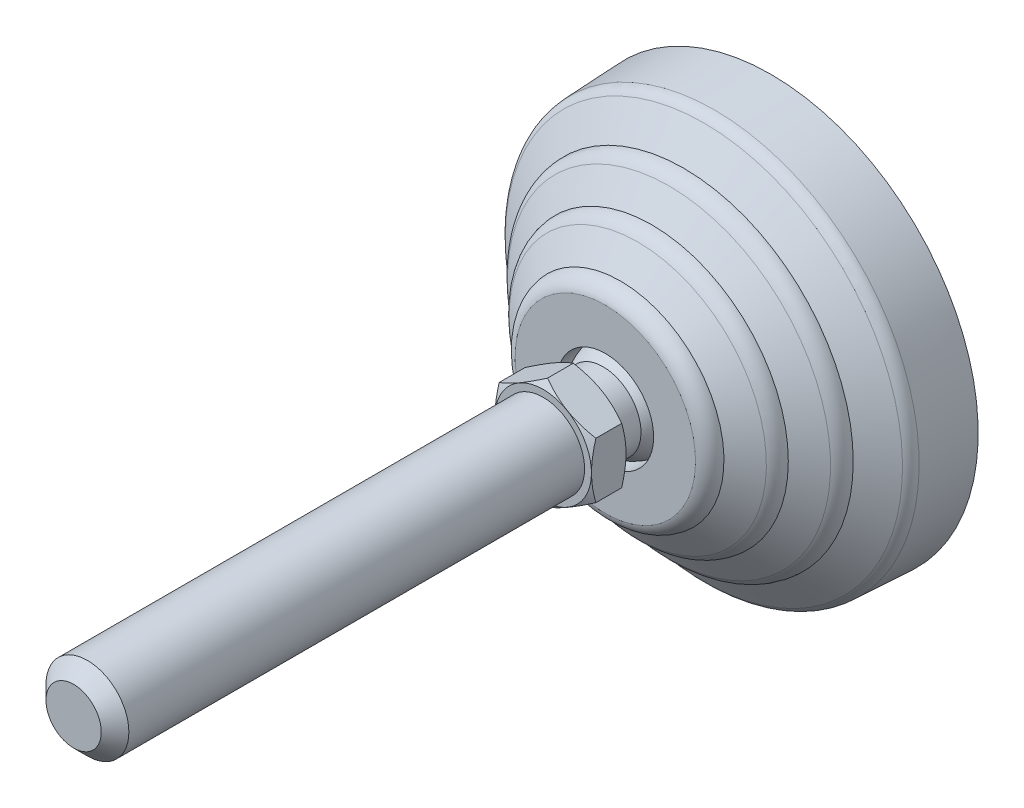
ISO-10303-21;
HEADER;
FILE_DESCRIPTION(('STEP AP214'),'2;1');
FILE_NAME('part.step','',(''),(''),'','','');
FILE_SCHEMA(('AUTOMOTIVE_DESIGN { 1 0 10303 214 1 1 1 1 }'));
ENDSEC;
DATA;
#1=APPLICATION_CONTEXT('core data for automotive mechanical design processes');
#2=APPLICATION_PROTOCOL_DEFINITION('international standard','automotive_design',2000,#1);
#3=PRODUCT_CONTEXT('',#1,'mechanical');
#4=PRODUCT('Part','Part','',(#3));
#5=PRODUCT_RELATED_PRODUCT_CATEGORY('part','',(#4));
#6=PRODUCT_DEFINITION_FORMATION('','',#4);
#7=PRODUCT_DEFINITION_CONTEXT('part definition',#1,'design');
#8=PRODUCT_DEFINITION('design','',#6,#7);
#9=PRODUCT_DEFINITION_SHAPE('','',#8);
#10=(LENGTH_UNIT() NAMED_UNIT(*) SI_UNIT(.MILLI.,.METRE.));
#11=(NAMED_UNIT(*) PLANE_ANGLE_UNIT() SI_UNIT($,.RADIAN.));
#12=(NAMED_UNIT(*) SI_UNIT($,.STERADIAN.) SOLID_ANGLE_UNIT());
#13=UNCERTAINTY_MEASURE_WITH_UNIT(LENGTH_MEASURE(1.E-05),#10,'distance_accuracy_value','');
#14=(GEOMETRIC_REPRESENTATION_CONTEXT(3) GLOBAL_UNCERTAINTY_ASSIGNED_CONTEXT((#13)) GLOBAL_UNIT_ASSIGNED_CONTEXT((#10,
#11,#12)) REPRESENTATION_CONTEXT('',''));
#15=CARTESIAN_POINT('',(0.,0.,0.));
#16=DIRECTION('',(0.,0.,1.));
#17=DIRECTION('',(1.,0.,0.));
#18=AXIS2_PLACEMENT_3D('',#15,#16,#17);
#19=CARTESIAN_POINT('',(0.,0.,65.9265));
#20=DIRECTION('',(0.,0.,-1.));
#21=DIRECTION('',(0.,1.,0.));
#22=AXIS2_PLACEMENT_3D('',#19,#20,#21);
#23=CYLINDRICAL_SURFACE('',#22,6.);
#24=CARTESIAN_POINT('',(0.,0.,99.));
#25=DIRECTION('',(0.,0.,1.));
#26=DIRECTION('',(0.,-1.,0.));
#27=AXIS2_PLACEMENT_3D('',#24,#25,#26);
#28=CIRCLE('',#27,6.);
#29=CARTESIAN_POINT('',(0.,-6.,99.));
#30=VERTEX_POINT('',#29);
#31=EDGE_CURVE('E9',#30,#30,#28,.F.);
#32=ORIENTED_EDGE('',*,*,#31,.T.);
#33=EDGE_LOOP('',(#32));
#34=FACE_BOUND('',#33,.T.);
#35=CARTESIAN_POINT('',(0.,0.,33.));
#36=DIRECTION('',(0.,0.,-1.));
#37=DIRECTION('',(0.,1.,0.));
#38=AXIS2_PLACEMENT_3D('',#35,#36,#37);
#39=CIRCLE('',#38,6.);
#40=CARTESIAN_POINT('',(0.,6.,33.));
#41=VERTEX_POINT('',#40);
#42=EDGE_CURVE('E124',#41,#41,#39,.F.);
#43=ORIENTED_EDGE('',*,*,#42,.T.);
#44=EDGE_LOOP('',(#43));
#45=FACE_BOUND('',#44,.T.);
#46=ADVANCED_FACE('F14',(#34,#45),#23,.T.);
#47=CARTESIAN_POINT('',(6.495,0.,33.));
#48=DIRECTION('',(0.,0.,1.));
#49=DIRECTION('',(0.,-1.,0.));
#50=AXIS2_PLACEMENT_3D('',#47,#48,#49);
#51=PLANE('',#50);
#52=CARTESIAN_POINT('',(0.,0.,33.));
#53=DIRECTION('',(0.,0.,-1.));
#54=DIRECTION('',(0.,1.,0.));
#55=AXIS2_PLACEMENT_3D('',#52,#53,#54);
#56=CIRCLE('',#55,6.99);
#57=CARTESIAN_POINT('',(0.,6.99,33.));
#58=VERTEX_POINT('',#57);
#59=EDGE_CURVE('E132',#58,#58,#56,.F.);
#60=ORIENTED_EDGE('',*,*,#59,.T.);
#61=EDGE_LOOP('',(#60));
#62=FACE_BOUND('',#61,.T.);
#63=ORIENTED_EDGE('',*,*,#42,.F.);
#64=EDGE_LOOP('',(#63));
#65=FACE_BOUND('',#64,.T.);
#66=ADVANCED_FACE('F157',(#62,#65),#51,.T.);
#67=CARTESIAN_POINT('',(0.,0.,32.3652257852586));
#68=DIRECTION('',(0.,0.,-1.));
#69=DIRECTION('',(0.,1.,0.));
#70=AXIS2_PLACEMENT_3D('',#67,#68,#69);
#71=CONICAL_SURFACE('',#70,8.08946119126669,1.0471975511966);
#72=ORIENTED_EDGE('',*,*,#59,.F.);
#73=EDGE_LOOP('',(#72));
#74=FACE_BOUND('',#73,.T.);
#75=CARTESIAN_POINT('',(-2.884812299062E-08,-8.08290378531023,32.3690117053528));
#76=CARTESIAN_POINT('',(0.153866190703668,-7.99406908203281,32.4202905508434));
#77=CARTESIAN_POINT('',(0.308306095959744,-7.9049031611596,32.4692419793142));
#78=CARTESIAN_POINT('',(0.618440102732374,-7.72584720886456,32.5618490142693));
#79=CARTESIAN_POINT('',(0.774134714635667,-7.63595688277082,32.6055023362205));
#80=CARTESIAN_POINT('',(1.24371124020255,-7.36484674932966,32.7276582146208));
#81=CARTESIAN_POINT('',(1.55944667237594,-7.18255681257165,32.79713799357));
#82=CARTESIAN_POINT('',(2.03193896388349,-6.90976326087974,32.8786092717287));
#83=CARTESIAN_POINT('',(2.18728420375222,-6.8200746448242,32.9018176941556));
#84=CARTESIAN_POINT('',(2.49867650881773,-6.64029221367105,32.9407338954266));
#85=CARTESIAN_POINT('',(2.65472351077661,-6.55019843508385,32.9564423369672));
#86=CARTESIAN_POINT('',(2.96708844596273,-6.36985445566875,32.9799582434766));
#87=CARTESIAN_POINT('',(3.12340586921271,-6.27960454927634,32.9877746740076));
#88=CARTESIAN_POINT('',(3.43617637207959,-6.09902641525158,32.9953473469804));
#89=CARTESIAN_POINT('',(3.59262944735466,-6.00869819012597,32.9951038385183));
#90=CARTESIAN_POINT('',(4.02123299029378,-5.76124381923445,32.9833586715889));
#91=CARTESIAN_POINT('',(4.29324307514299,-5.60419872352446,32.9636515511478));
#92=CARTESIAN_POINT('',(4.8354566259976,-5.29115158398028,32.9011668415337));
#93=CARTESIAN_POINT('',(5.10565818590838,-5.13515064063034,32.8583679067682));
#94=CARTESIAN_POINT('',(5.64896244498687,-4.82147378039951,32.7513856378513));
#95=CARTESIAN_POINT('',(5.92199660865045,-4.66383743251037,32.6867491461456));
#96=CARTESIAN_POINT('',(6.46399382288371,-4.35091519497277,32.5400514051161));
#97=CARTESIAN_POINT('',(6.73296381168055,-4.19562529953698,32.4580246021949));
#98=CARTESIAN_POINT('',(6.99999992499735,-4.04145192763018,32.3690117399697));
#99=B_SPLINE_CURVE_WITH_KNOTS('',3,(#75,#76,#77,#78,#79,#80,#81,#82,#83,#84,#85,#86,#87,#88,#89,
#90,#91,#92,#93,#94,#95,#96,#97,#98),.UNSPECIFIED.,.F.,.F.,(4,2,2,2,2,2,2,2,2,2,2,4),(0.,
0.554720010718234,1.1096783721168,2.22190069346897,2.76439121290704,3.30683378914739,
3.84865943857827,4.39046834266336,5.33360245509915,6.27760987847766,7.24255086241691,
8.20559807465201),.UNSPECIFIED.);
#100=CARTESIAN_POINT('',(-1.44240629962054E-08,-8.0829037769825,32.3690117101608));
#101=VERTEX_POINT('',#100);
#102=CARTESIAN_POINT('',(7.,-4.04145190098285,32.3690117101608));
#103=VERTEX_POINT('',#102);
#104=EDGE_CURVE('E143',#101,#103,#99,.T.);
#105=ORIENTED_EDGE('',*,*,#104,.T.);
#106=CARTESIAN_POINT('',(7.,-4.04145191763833,32.3690117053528));
#107=CARTESIAN_POINT('',(7.,-3.70968878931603,32.4647934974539));
#108=CARTESIAN_POINT('',(7.,-3.37530112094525,32.5524844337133));
#109=CARTESIAN_POINT('',(7.,-2.70109388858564,32.7074672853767));
#110=CARTESIAN_POINT('',(7.,-2.36126392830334,32.7747135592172));
#111=CARTESIAN_POINT('',(7.,-1.68541720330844,32.882853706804));
#112=CARTESIAN_POINT('',(7.,-1.34949559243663,32.9243241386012));
#113=CARTESIAN_POINT('',(7.,-0.675714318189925,32.9799957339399));
#114=CARTESIAN_POINT('',(7.,-0.3378571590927,32.9942264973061));
#115=CARTESIAN_POINT('',(7.,0.337857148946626,32.9942264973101));
#116=CARTESIAN_POINT('',(7.,0.675714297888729,32.9799957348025));
#117=CARTESIAN_POINT('',(7.,1.34949555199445,32.9243241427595));
#118=CARTESIAN_POINT('',(7.,1.68541715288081,32.8828537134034));
#119=CARTESIAN_POINT('',(7.,2.36126385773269,32.7747135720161));
#120=CARTESIAN_POINT('',(7.,2.70109380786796,32.7074673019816));
#121=CARTESIAN_POINT('',(7.,3.37530102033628,32.5524844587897));
#122=CARTESIAN_POINT('',(7.,3.70968867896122,32.4647935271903));
#123=CARTESIAN_POINT('',(7.,4.04145179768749,32.3690117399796));
#124=B_SPLINE_CURVE_WITH_KNOTS('',3,(#106,#107,#108,#109,#110,#111,#112,#113,#114,#115,#116,
#117,#118,#119,#120,#121,#122,#123),.UNSPECIFIED.,.F.,.F.,(4,2,2,2,2,2,2,2,4),(0.,
1.03625689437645,2.07481046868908,3.08920803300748,4.10250268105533,5.11579729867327,
6.13019483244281,7.16874837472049,8.20500523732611),.UNSPECIFIED.);
#125=CARTESIAN_POINT('',(7.00000001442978,4.04145187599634,32.3690117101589));
#126=VERTEX_POINT('',#125);
#127=EDGE_CURVE('E135',#103,#126,#124,.T.);
#128=ORIENTED_EDGE('',*,*,#127,.T.);
#129=CARTESIAN_POINT('',(7.00000002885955,4.04145186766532,32.3690117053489));
#130=CARTESIAN_POINT('',(6.84613380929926,4.13028657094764,32.4202905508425));
#131=CARTESIAN_POINT('',(6.69169390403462,4.2194524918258,32.4692419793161));
#132=CARTESIAN_POINT('',(6.3815598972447,4.39850844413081,32.5618490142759));
#133=CARTESIAN_POINT('',(6.2258652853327,4.48839877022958,32.6055023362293));
#134=CARTESIAN_POINT('',(5.75628875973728,4.75950890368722,32.7276582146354));
#135=CARTESIAN_POINT('',(5.44055332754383,4.94179884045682,32.797137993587));
#136=CARTESIAN_POINT('',(4.96806103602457,5.21459239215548,32.8786092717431));
#137=CARTESIAN_POINT('',(4.81271579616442,5.30428100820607,32.9018176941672));
#138=CARTESIAN_POINT('',(4.50132349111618,5.48406343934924,32.9407338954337));
#139=CARTESIAN_POINT('',(4.345276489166,5.57415721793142,32.9564423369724));
#140=CARTESIAN_POINT('',(4.0329115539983,5.75450119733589,32.9799582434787));
#141=CARTESIAN_POINT('',(3.87659413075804,5.84475110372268,32.9877746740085));
#142=CARTESIAN_POINT('',(3.56382362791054,6.02532923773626,32.9953473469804));
#143=CARTESIAN_POINT('',(3.40737055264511,6.1156574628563,32.9951038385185));
#144=CARTESIAN_POINT('',(2.97876700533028,6.36311183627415,32.9833586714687));
#145=CARTESIAN_POINT('',(2.70675691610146,6.5201569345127,32.9636515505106));
#146=CARTESIAN_POINT('',(2.16454335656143,6.8332040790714,32.9011668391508));
#147=CARTESIAN_POINT('',(1.89434179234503,6.9892050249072,32.8583679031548));
#148=CARTESIAN_POINT('',(1.35103752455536,7.30288189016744,32.7513856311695));
#149=CARTESIAN_POINT('',(1.07800335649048,7.46051824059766,32.6867491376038));
#150=CARTESIAN_POINT('',(0.536006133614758,7.77344048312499,32.5400513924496));
#151=CARTESIAN_POINT('',(0.267036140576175,7.92873038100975,32.4580245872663));
#152=CARTESIAN_POINT('',(2.30772582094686E-08,8.0829037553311,32.3690117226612));
#153=B_SPLINE_CURVE_WITH_KNOTS('',3,(#129,#130,#131,#132,#133,#134,#135,#136,#137,#138,#139,
#140,#141,#142,#143,#144,#145,#146,#147,#148,#149,#150,#151,#152),.UNSPECIFIED.,.F.,.F.,(4,2,2,
2,2,2,2,2,2,2,2,4),(0.,0.554720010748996,1.10967837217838,2.22190069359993,2.7643912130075,
3.30683378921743,3.84865943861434,4.3904683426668,5.33360247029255,6.2776099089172,
7.24255090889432,8.20559813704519),.UNSPECIFIED.);
#154=CARTESIAN_POINT('',(-1.15386261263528E-08,8.08290376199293,32.369011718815));
#155=VERTEX_POINT('',#154);
#156=EDGE_CURVE('E181',#126,#155,#153,.T.);
#157=ORIENTED_EDGE('',*,*,#156,.T.);
#158=CARTESIAN_POINT('',(-2.30772558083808E-08,8.0829037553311,32.3690117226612));
#159=CARTESIAN_POINT('',(-0.153866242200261,7.99406905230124,32.4202905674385));
#160=CARTESIAN_POINT('',(-0.308306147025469,7.90490313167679,32.4692419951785));
#161=CARTESIAN_POINT('',(-0.618440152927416,7.72584717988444,32.5618490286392));
#162=CARTESIAN_POINT('',(-0.77413476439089,7.63595685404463,32.6055023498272));
#163=CARTESIAN_POINT('',(-1.24371128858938,7.3648467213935,32.7276582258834));
#164=CARTESIAN_POINT('',(-1.55944671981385,7.18255678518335,32.7971380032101));
#165=CARTESIAN_POINT('',(-2.03193900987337,6.90976323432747,32.878609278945));
#166=CARTESIAN_POINT('',(-2.18728424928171,6.82007461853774,32.9018177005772));
#167=CARTESIAN_POINT('',(-2.49867655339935,6.64029218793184,32.9407339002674));
#168=CARTESIAN_POINT('',(-2.65472355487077,6.55019840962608,32.9564423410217));
#169=CARTESIAN_POINT('',(-2.96708848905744,6.369854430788,32.9799582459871));
#170=CARTESIAN_POINT('',(-3.12340591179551,6.27960452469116,32.98777467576));
#171=CARTESIAN_POINT('',(-3.43617641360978,6.09902639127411,32.9953473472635));
#172=CARTESIAN_POINT('',(-3.59262948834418,6.00869816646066,32.99510383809));
#173=CARTESIAN_POINT('',(-4.02123302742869,5.76124379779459,32.9833586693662));
#174=CARTESIAN_POINT('',(-4.29324310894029,5.60419870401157,32.9636515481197));
#175=CARTESIAN_POINT('',(-4.83545665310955,5.2911515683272,32.9011668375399));
#176=CARTESIAN_POINT('',(-5.10565820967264,5.13515062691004,32.8583679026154));
#177=CARTESIAN_POINT('',(-5.64896246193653,4.82147377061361,32.7513856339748));
#178=CARTESIAN_POINT('',(-5.92199662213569,4.66383742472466,32.6867491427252));
#179=CARTESIAN_POINT('',(-6.46399382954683,4.35091519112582,32.5400514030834));
#180=CARTESIAN_POINT('',(-6.73296381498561,4.19562529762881,32.4580246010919));
#181=CARTESIAN_POINT('',(-6.99999992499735,4.04145192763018,32.3690117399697));
#182=B_SPLINE_CURVE_WITH_KNOTS('',3,(#158,#159,#160,#161,#162,#163,#164,#165,#166,#167,#168,
#169,#170,#171,#172,#173,#174,#175,#176,#177,#178,#179,#180,#181),.UNSPECIFIED.,.F.,.F.,(4,2,2,
2,2,2,2,2,2,2,2,4),(0.,0.554720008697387,1.10967836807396,2.22190068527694,2.76439120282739,
3.30683377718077,3.8486594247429,4.39046832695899,5.33360242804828,6.27760984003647,
7.24255081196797,8.20559801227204),.UNSPECIFIED.);
#183=CARTESIAN_POINT('',(-7.,4.04145190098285,32.3690117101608));
#184=VERTEX_POINT('',#183);
#185=EDGE_CURVE('E173',#155,#184,#182,.T.);
#186=ORIENTED_EDGE('',*,*,#185,.T.);
#187=CARTESIAN_POINT('',(-7.,4.04145191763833,32.3690117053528));
#188=CARTESIAN_POINT('',(-7.,3.70968878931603,32.4647934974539));
#189=CARTESIAN_POINT('',(-7.,3.37530112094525,32.5524844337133));
#190=CARTESIAN_POINT('',(-7.,2.70109388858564,32.7074672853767));
#191=CARTESIAN_POINT('',(-7.,2.36126392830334,32.7747135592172));
#192=CARTESIAN_POINT('',(-7.,1.68541720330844,32.882853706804));
#193=CARTESIAN_POINT('',(-7.,1.34949559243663,32.9243241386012));
#194=CARTESIAN_POINT('',(-7.,0.675714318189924,32.9799957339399));
#195=CARTESIAN_POINT('',(-7.,0.3378571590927,32.9942264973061));
#196=CARTESIAN_POINT('',(-7.,-0.337857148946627,32.9942264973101));
#197=CARTESIAN_POINT('',(-7.,-0.675714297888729,32.9799957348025));
#198=CARTESIAN_POINT('',(-7.,-1.34949555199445,32.9243241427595));
#199=CARTESIAN_POINT('',(-7.,-1.68541715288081,32.8828537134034));
#200=CARTESIAN_POINT('',(-7.,-2.36126385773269,32.7747135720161));
#201=CARTESIAN_POINT('',(-7.,-2.70109380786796,32.7074673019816));
#202=CARTESIAN_POINT('',(-7.,-3.37530102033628,32.5524844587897));
#203=CARTESIAN_POINT('',(-7.,-3.70968867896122,32.4647935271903));
#204=CARTESIAN_POINT('',(-7.,-4.04145179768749,32.3690117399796));
#205=B_SPLINE_CURVE_WITH_KNOTS('',3,(#187,#188,#189,#190,#191,#192,#193,#194,#195,#196,#197,
#198,#199,#200,#201,#202,#203,#204),.UNSPECIFIED.,.F.,.F.,(4,2,2,2,2,2,2,2,4),(0.,
1.03625689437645,2.07481046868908,3.08920803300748,4.10250268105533,5.11579729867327,
6.13019483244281,7.16874837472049,8.20500523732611),.UNSPECIFIED.);
#206=CARTESIAN_POINT('',(-7.00000001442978,-4.04145187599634,32.3690117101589));
#207=VERTEX_POINT('',#206);
#208=EDGE_CURVE('E342',#184,#207,#205,.T.);
#209=ORIENTED_EDGE('',*,*,#208,.T.);
#210=CARTESIAN_POINT('',(-7.00000002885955,-4.04145186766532,32.3690117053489));
#211=CARTESIAN_POINT('',(-6.84613380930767,-4.13028657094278,32.4202905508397));
#212=CARTESIAN_POINT('',(-6.6916939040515,-4.21945249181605,32.4692419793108));
#213=CARTESIAN_POINT('',(-6.38155989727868,-4.39850844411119,32.5618490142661));
#214=CARTESIAN_POINT('',(-6.22586528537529,-4.48839877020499,32.6055023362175));
#215=CARTESIAN_POINT('',(-5.7562887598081,-4.75950890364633,32.7276582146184));
#216=CARTESIAN_POINT('',(-5.4405533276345,-4.94179884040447,32.7971379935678));
#217=CARTESIAN_POINT('',(-4.96806103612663,-5.21459239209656,32.8786092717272));
#218=CARTESIAN_POINT('',(-4.81271579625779,-5.30428100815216,32.9018176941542));
#219=CARTESIAN_POINT('',(-4.50132349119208,-5.48406343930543,32.9407338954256));
#220=CARTESIAN_POINT('',(-4.34527648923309,-5.57415721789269,32.9564423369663));
#221=CARTESIAN_POINT('',(-4.03291155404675,-5.75450119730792,32.9799582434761));
#222=CARTESIAN_POINT('',(-3.87659413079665,-5.84475110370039,32.9877746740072));
#223=CARTESIAN_POINT('',(-3.56382362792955,-6.02532923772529,32.9953473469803));
#224=CARTESIAN_POINT('',(-3.40737055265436,-6.11565746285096,32.9951038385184));
#225=CARTESIAN_POINT('',(-2.97876700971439,-6.36311183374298,32.9833586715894));
#226=CARTESIAN_POINT('',(-2.70675692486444,-6.52015692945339,32.9636515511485));
#227=CARTESIAN_POINT('',(-2.16454337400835,-6.83320406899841,32.9011668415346));
#228=CARTESIAN_POINT('',(-1.89434181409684,-6.98920501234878,32.8583679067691));
#229=CARTESIAN_POINT('',(-1.35103755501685,-7.30288187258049,32.7513856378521));
#230=CARTESIAN_POINT('',(-1.07800339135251,-7.46051822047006,32.6867491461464));
#231=CARTESIAN_POINT('',(-0.536006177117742,-7.77344045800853,32.5400514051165));
#232=CARTESIAN_POINT('',(-0.267036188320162,-7.92873035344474,32.4580246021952));
#233=CARTESIAN_POINT('',(-7.50026377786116E-08,-8.08290372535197,32.3690117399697));
#234=B_SPLINE_CURVE_WITH_KNOTS('',3,(#210,#211,#212,#213,#214,#215,#216,#217,#218,#219,#220,
#221,#222,#223,#224,#225,#226,#227,#228,#229,#230,#231,#232,#233),.UNSPECIFIED.,.F.,.F.,(4,2,2,
2,2,2,2,2,2,2,2,4),(0.,0.554720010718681,1.1096783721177,2.22190069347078,2.76439121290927,
3.30683378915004,3.84865943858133,4.39046834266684,5.33360245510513,6.27760987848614,
7.24255086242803,8.20559807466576),.UNSPECIFIED.);
#235=EDGE_CURVE('E163',#207,#101,#234,.T.);
#236=ORIENTED_EDGE('',*,*,#235,.T.);
#237=EDGE_LOOP('',(#105,#128,#157,#186,#209,#236));
#238=FACE_BOUND('',#237,.T.);
#239=ADVANCED_FACE('F152',(#74,#238),#71,.T.);
#240=CARTESIAN_POINT('',(0.,-8.08290376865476,33.1));
#241=DIRECTION('',(0.5,0.866025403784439,0.));
#242=DIRECTION('',(-0.866025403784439,0.5,0.));
#243=AXIS2_PLACEMENT_3D('',#240,#241,#242);
#244=PLANE('',#243);
#245=DIRECTION('',(0.,0.,1.));
#246=VECTOR('',#245,1.);
#247=CARTESIAN_POINT('',(0.,-8.08290376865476,33.1));
#248=LINE('',#247,#246);
#249=CARTESIAN_POINT('',(0.,-8.08290376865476,28.6309882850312));
#250=VERTEX_POINT('',#249);
#251=EDGE_CURVE('E368',#250,#101,#248,.T.);
#252=ORIENTED_EDGE('',*,*,#251,.T.);
#253=ORIENTED_EDGE('',*,*,#235,.F.);
#254=DIRECTION('',(0.,0.,1.));
#255=VECTOR('',#254,1.);
#256=CARTESIAN_POINT('',(-7.,-4.04145188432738,33.1));
#257=LINE('',#256,#255);
#258=CARTESIAN_POINT('',(-7.,-4.04145188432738,28.6309882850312));
#259=VERTEX_POINT('',#258);
#260=EDGE_CURVE('E360',#259,#207,#257,.T.);
#261=ORIENTED_EDGE('',*,*,#260,.F.);
#262=CARTESIAN_POINT('',(0.,-8.08290376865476,28.6309882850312));
#263=CARTESIAN_POINT('',(-0.153866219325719,-7.99406906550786,28.5797094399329));
#264=CARTESIAN_POINT('',(-0.308306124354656,-7.90490314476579,28.5307580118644));
#265=CARTESIAN_POINT('',(-0.618440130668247,-7.72584719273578,28.4381509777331));
#266=CARTESIAN_POINT('',(-0.774134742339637,-7.63595686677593,28.3944976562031));
#267=CARTESIAN_POINT('',(-1.24371126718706,-7.36484673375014,28.2723417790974));
#268=CARTESIAN_POINT('',(-1.55944669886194,-7.18255679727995,28.2028620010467));
#269=CARTESIAN_POINT('',(-2.03193898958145,-6.90976324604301,28.1213907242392));
#270=CARTESIAN_POINT('',(-2.18728422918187,-6.82007463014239,28.098182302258));
#271=CARTESIAN_POINT('',(-2.49867653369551,-6.64029219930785,28.0592661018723));
#272=CARTESIAN_POINT('',(-2.65472353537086,-6.55019842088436,28.0435576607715));
#273=CARTESIAN_POINT('',(-2.96708846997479,-6.36985444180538,28.0200417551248));
#274=CARTESIAN_POINT('',(-3.12340589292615,-6.27960453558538,28.012225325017));
#275=CARTESIAN_POINT('',(-3.43617639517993,-6.09902640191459,28.0046526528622));
#276=CARTESIAN_POINT('',(-3.59262947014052,-6.00869817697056,28.0048961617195));
#277=CARTESIAN_POINT('',(-4.02123301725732,-5.76124380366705,28.0166413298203));
#278=CARTESIAN_POINT('',(-4.29324310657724,-5.60419870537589,28.0363484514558));
#279=CARTESIAN_POINT('',(-4.83545666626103,-5.29115156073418,28.0988331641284));
#280=CARTESIAN_POINT('',(-5.10565823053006,-5.135150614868,28.1416321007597));
#281=CARTESIAN_POINT('',(-5.64896249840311,-4.82147374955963,28.248614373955));
#282=CARTESIAN_POINT('',(-5.92199666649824,-4.66383739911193,28.3132508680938));
#283=CARTESIAN_POINT('',(-6.46399388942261,-4.35091515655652,28.4599486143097));
#284=CARTESIAN_POINT('',(-6.73296388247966,-4.1956252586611,28.5419754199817));
#285=CARTESIAN_POINT('',(-7.,-4.04145188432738,28.6309882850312));
#286=B_SPLINE_CURVE_WITH_KNOTS('',3,(#262,#263,#264,#265,#266,#267,#268,#269,#270,#271,#272,
#273,#274,#275,#276,#277,#278,#279,#280,#281,#282,#283,#284,#285),.UNSPECIFIED.,.F.,.F.,(4,2,2,
2,2,2,2,2,2,2,2,4),(0.,0.5547200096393,1.10967836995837,2.22190068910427,2.76439120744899,
3.30683378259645,3.84865943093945,4.39046833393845,5.33360246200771,6.2776099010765,
7.24255090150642,8.20559813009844),.UNSPECIFIED.);
#287=EDGE_CURVE('E362',#250,#259,#286,.T.);
#288=ORIENTED_EDGE('',*,*,#287,.F.);
#289=EDGE_LOOP('',(#252,#253,#261,#288));
#290=FACE_BOUND('',#289,.T.);
#291=ADVANCED_FACE('F156',(#290),#244,.F.);
#292=CARTESIAN_POINT('',(7.,-4.04145188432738,33.1));
#293=DIRECTION('',(-0.5,0.866025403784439,0.));
#294=DIRECTION('',(-0.866025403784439,-0.5,0.));
#295=AXIS2_PLACEMENT_3D('',#292,#293,#294);
#296=PLANE('',#295);
#297=DIRECTION('',(0.,0.,1.));
#298=VECTOR('',#297,1.);
#299=CARTESIAN_POINT('',(7.,-4.04145188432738,33.1));
#300=LINE('',#299,#298);
#301=CARTESIAN_POINT('',(7.,-4.04145188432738,28.6309882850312));
#302=VERTEX_POINT('',#301);
#303=EDGE_CURVE('E31',#302,#103,#300,.T.);
#304=ORIENTED_EDGE('',*,*,#303,.T.);
#305=ORIENTED_EDGE('',*,*,#104,.F.);
#306=ORIENTED_EDGE('',*,*,#251,.F.);
#307=CARTESIAN_POINT('',(7.,-4.04145188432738,28.6309882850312));
#308=CARTESIAN_POINT('',(6.84613378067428,-4.13028658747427,28.5797094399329));
#309=CARTESIAN_POINT('',(6.69169387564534,-4.21945250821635,28.5307580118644));
#310=CARTESIAN_POINT('',(6.38155986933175,-4.39850846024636,28.4381509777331));
#311=CARTESIAN_POINT('',(6.22586525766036,-4.48839878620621,28.3944976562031));
#312=CARTESIAN_POINT('',(5.75628873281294,-4.759508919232,28.2723417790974));
#313=CARTESIAN_POINT('',(5.44055330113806,-4.94179885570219,28.2028620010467));
#314=CARTESIAN_POINT('',(4.96806101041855,-5.21459240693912,28.1213907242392));
#315=CARTESIAN_POINT('',(4.81271577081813,-5.30428102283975,28.098182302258));
#316=CARTESIAN_POINT('',(4.50132346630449,-5.48406345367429,28.0592661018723));
#317=CARTESIAN_POINT('',(4.34527646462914,-5.57415723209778,28.0435576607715));
#318=CARTESIAN_POINT('',(4.0329115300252,-5.75450121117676,28.0200417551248));
#319=CARTESIAN_POINT('',(3.87659410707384,-5.84475111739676,28.012225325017));
#320=CARTESIAN_POINT('',(3.56382360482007,-6.02532925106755,28.0046526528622));
#321=CARTESIAN_POINT('',(3.40737052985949,-6.11565747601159,28.0048961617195));
#322=CARTESIAN_POINT('',(2.97876698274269,-6.36311184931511,28.0166413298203));
#323=CARTESIAN_POINT('',(2.70675689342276,-6.52015694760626,28.0363484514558));
#324=CARTESIAN_POINT('',(2.16454333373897,-6.83320409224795,28.0988331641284));
#325=CARTESIAN_POINT('',(1.89434176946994,-6.98920503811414,28.1416321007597));
#326=CARTESIAN_POINT('',(1.35103750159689,-7.30288190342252,28.248614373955));
#327=CARTESIAN_POINT('',(1.07800333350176,-7.4605182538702,28.3132508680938));
#328=CARTESIAN_POINT('',(0.536006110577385,-7.77344049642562,28.4599486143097));
#329=CARTESIAN_POINT('',(0.267036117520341,-7.92873039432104,28.5419754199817));
#330=CARTESIAN_POINT('',(0.,-8.08290376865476,28.6309882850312));
#331=B_SPLINE_CURVE_WITH_KNOTS('',3,(#307,#308,#309,#310,#311,#312,#313,#314,#315,#316,#317,
#318,#319,#320,#321,#322,#323,#324,#325,#326,#327,#328,#329,#330),.UNSPECIFIED.,.F.,.F.,(4,2,2,
2,2,2,2,2,2,2,2,4),(0.,0.5547200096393,1.10967836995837,2.22190068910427,2.76439120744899,
3.30683378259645,3.84865943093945,4.39046833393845,5.33360246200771,6.2776099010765,
7.24255090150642,8.20559813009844),.UNSPECIFIED.);
#332=EDGE_CURVE('E369',#302,#250,#331,.T.);
#333=ORIENTED_EDGE('',*,*,#332,.F.);
#334=EDGE_LOOP('',(#304,#305,#306,#333));
#335=FACE_BOUND('',#334,.T.);
#336=ADVANCED_FACE('F375',(#335),#296,.F.);
#337=CARTESIAN_POINT('',(-7.,4.04145188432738,33.1));
#338=DIRECTION('',(0.5,-0.866025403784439,0.));
#339=DIRECTION('',(0.866025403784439,0.5,0.));
#340=AXIS2_PLACEMENT_3D('',#337,#338,#339);
#341=PLANE('',#340);
#342=DIRECTION('',(0.,0.,1.));
#343=VECTOR('',#342,1.);
#344=CARTESIAN_POINT('',(-7.,4.04145188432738,33.1));
#345=LINE('',#344,#343);
#346=CARTESIAN_POINT('',(-7.,4.04145188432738,28.6309882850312));
#347=VERTEX_POINT('',#346);
#348=EDGE_CURVE('E361',#347,#184,#345,.T.);
#349=ORIENTED_EDGE('',*,*,#348,.T.);
#350=ORIENTED_EDGE('',*,*,#185,.F.);
#351=DIRECTION('',(0.,0.,1.));
#352=VECTOR('',#351,1.);
#353=CARTESIAN_POINT('',(0.,8.08290376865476,33.1));
#354=LINE('',#353,#352);
#355=CARTESIAN_POINT('',(0.,8.08290376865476,28.6309882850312));
#356=VERTEX_POINT('',#355);
#357=EDGE_CURVE('E212',#356,#155,#354,.T.);
#358=ORIENTED_EDGE('',*,*,#357,.F.);
#359=CARTESIAN_POINT('',(-7.,4.04145188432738,28.6309882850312));
#360=CARTESIAN_POINT('',(-6.84613378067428,4.13028658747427,28.5797094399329));
#361=CARTESIAN_POINT('',(-6.69169387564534,4.21945250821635,28.5307580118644));
#362=CARTESIAN_POINT('',(-6.38155986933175,4.39850846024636,28.4381509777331));
#363=CARTESIAN_POINT('',(-6.22586525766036,4.48839878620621,28.3944976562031));
#364=CARTESIAN_POINT('',(-5.75628873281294,4.759508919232,28.2723417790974));
#365=CARTESIAN_POINT('',(-5.44055330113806,4.94179885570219,28.2028620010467));
#366=CARTESIAN_POINT('',(-4.96806101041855,5.21459240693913,28.1213907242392));
#367=CARTESIAN_POINT('',(-4.81271577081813,5.30428102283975,28.098182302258));
#368=CARTESIAN_POINT('',(-4.50132346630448,5.48406345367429,28.0592661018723));
#369=CARTESIAN_POINT('',(-4.34527646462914,5.57415723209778,28.0435576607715));
#370=CARTESIAN_POINT('',(-4.0329115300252,5.75450121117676,28.0200417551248));
#371=CARTESIAN_POINT('',(-3.87659410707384,5.84475111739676,28.0122253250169));
#372=CARTESIAN_POINT('',(-3.56382360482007,6.02532925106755,28.0046526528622));
#373=CARTESIAN_POINT('',(-3.40737052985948,6.11565747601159,28.0048961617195));
#374=CARTESIAN_POINT('',(-2.97876698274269,6.36311184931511,28.0166413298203));
#375=CARTESIAN_POINT('',(-2.70675689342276,6.52015694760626,28.0363484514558));
#376=CARTESIAN_POINT('',(-2.16454333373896,6.83320409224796,28.0988331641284));
#377=CARTESIAN_POINT('',(-1.89434176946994,6.98920503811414,28.1416321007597));
#378=CARTESIAN_POINT('',(-1.35103750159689,7.30288190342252,28.248614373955));
#379=CARTESIAN_POINT('',(-1.07800333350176,7.46051825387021,28.3132508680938));
#380=CARTESIAN_POINT('',(-0.536006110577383,7.77344049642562,28.4599486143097));
#381=CARTESIAN_POINT('',(-0.267036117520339,7.92873039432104,28.5419754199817));
#382=CARTESIAN_POINT('',(0.,8.08290376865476,28.6309882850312));
#383=B_SPLINE_CURVE_WITH_KNOTS('',3,(#359,#360,#361,#362,#363,#364,#365,#366,#367,#368,#369,
#370,#371,#372,#373,#374,#375,#376,#377,#378,#379,#380,#381,#382),.UNSPECIFIED.,.F.,.F.,(4,2,2,
2,2,2,2,2,2,2,2,4),(0.,0.554720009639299,1.10967836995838,2.22190068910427,2.76439120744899,
3.30683378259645,3.84865943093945,4.39046833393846,5.33360246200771,6.27760990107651,
7.24255090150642,8.20559813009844),.UNSPECIFIED.);
#384=EDGE_CURVE('E214',#347,#356,#383,.T.);
#385=ORIENTED_EDGE('',*,*,#384,.F.);
#386=EDGE_LOOP('',(#349,#350,#358,#385));
#387=FACE_BOUND('',#386,.T.);
#388=ADVANCED_FACE('F200',(#387),#341,.F.);
#389=CARTESIAN_POINT('',(-7.,-4.04145188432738,33.1));
#390=DIRECTION('',(1.,0.,0.));
#391=DIRECTION('',(0.,1.,0.));
#392=AXIS2_PLACEMENT_3D('',#389,#390,#391);
#393=PLANE('',#392);
#394=ORIENTED_EDGE('',*,*,#260,.T.);
#395=ORIENTED_EDGE('',*,*,#208,.F.);
#396=ORIENTED_EDGE('',*,*,#348,.F.);
#397=CARTESIAN_POINT('',(-7.,-4.04145188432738,28.6309882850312));
#398=CARTESIAN_POINT('',(-7.,-3.70968875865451,28.5352064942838));
#399=CARTESIAN_POINT('',(-7.,-3.3753010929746,28.4475155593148));
#400=CARTESIAN_POINT('',(-7.,-2.7010938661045,28.292532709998));
#401=CARTESIAN_POINT('',(-7.,-2.36126390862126,28.2252864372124));
#402=CARTESIAN_POINT('',(-7.,-1.68541718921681,28.1171462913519));
#403=CARTESIAN_POINT('',(-7.,-1.3494955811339,28.075675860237));
#404=CARTESIAN_POINT('',(-7.,-0.675714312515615,28.0200042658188));
#405=CARTESIAN_POINT('',(-7.,-0.337857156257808,28.0057735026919));
#406=CARTESIAN_POINT('',(-7.,0.337857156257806,28.0057735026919));
#407=CARTESIAN_POINT('',(-7.,0.675714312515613,28.0200042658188));
#408=CARTESIAN_POINT('',(-7.,1.3494955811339,28.075675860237));
#409=CARTESIAN_POINT('',(-7.,1.68541718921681,28.1171462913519));
#410=CARTESIAN_POINT('',(-7.,2.36126390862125,28.2252864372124));
#411=CARTESIAN_POINT('',(-7.,2.7010938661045,28.292532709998));
#412=CARTESIAN_POINT('',(-7.,3.3753010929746,28.4475155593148));
#413=CARTESIAN_POINT('',(-7.,3.70968875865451,28.5352064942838));
#414=CARTESIAN_POINT('',(-7.,4.04145188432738,28.6309882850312));
#415=B_SPLINE_CURVE_WITH_KNOTS('',3,(#397,#398,#399,#400,#401,#402,#403,#404,#405,#406,#407,
#408,#409,#410,#411,#412,#413,#414),.UNSPECIFIED.,.F.,.F.,(4,2,2,2,2,2,2,2,4),(0.,
1.03625688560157,2.07481045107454,3.08920800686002,4.10250264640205,5.11579728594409,
6.13019484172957,7.16874840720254,8.20500529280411),.UNSPECIFIED.);
#416=EDGE_CURVE('E354',#259,#347,#415,.T.);
#417=ORIENTED_EDGE('',*,*,#416,.F.);
#418=EDGE_LOOP('',(#394,#395,#396,#417));
#419=FACE_BOUND('',#418,.T.);
#420=ADVANCED_FACE('F348',(#419),#393,.F.);
#421=CARTESIAN_POINT('',(7.,4.04145188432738,33.1));
#422=DIRECTION('',(-1.,0.,0.));
#423=DIRECTION('',(0.,-1.,0.));
#424=AXIS2_PLACEMENT_3D('',#421,#422,#423);
#425=PLANE('',#424);
#426=DIRECTION('',(0.,0.,1.));
#427=VECTOR('',#426,1.);
#428=CARTESIAN_POINT('',(7.,4.04145188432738,33.1));
#429=LINE('',#428,#427);
#430=CARTESIAN_POINT('',(7.,4.04145188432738,28.6309882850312));
#431=VERTEX_POINT('',#430);
#432=EDGE_CURVE('E402',#126,#431,#429,.F.);
#433=ORIENTED_EDGE('',*,*,#432,.F.);
#434=ORIENTED_EDGE('',*,*,#127,.F.);
#435=ORIENTED_EDGE('',*,*,#303,.F.);
#436=CARTESIAN_POINT('',(7.,4.04145188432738,28.6309882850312));
#437=CARTESIAN_POINT('',(7.,3.70968875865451,28.5352064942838));
#438=CARTESIAN_POINT('',(7.,3.3753010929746,28.4475155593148));
#439=CARTESIAN_POINT('',(7.,2.7010938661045,28.292532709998));
#440=CARTESIAN_POINT('',(7.,2.36126390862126,28.2252864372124));
#441=CARTESIAN_POINT('',(7.,1.68541718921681,28.1171462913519));
#442=CARTESIAN_POINT('',(7.,1.3494955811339,28.075675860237));
#443=CARTESIAN_POINT('',(7.,0.675714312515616,28.0200042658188));
#444=CARTESIAN_POINT('',(7.,0.33785715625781,28.0057735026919));
#445=CARTESIAN_POINT('',(7.,-0.337857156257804,28.0057735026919));
#446=CARTESIAN_POINT('',(7.,-0.675714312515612,28.0200042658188));
#447=CARTESIAN_POINT('',(7.,-1.3494955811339,28.075675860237));
#448=CARTESIAN_POINT('',(7.,-1.68541718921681,28.1171462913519));
#449=CARTESIAN_POINT('',(7.,-2.36126390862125,28.2252864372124));
#450=CARTESIAN_POINT('',(7.,-2.7010938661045,28.292532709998));
#451=CARTESIAN_POINT('',(7.,-3.3753010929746,28.4475155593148));
#452=CARTESIAN_POINT('',(7.,-3.70968875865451,28.5352064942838));
#453=CARTESIAN_POINT('',(7.,-4.04145188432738,28.6309882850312));
#454=B_SPLINE_CURVE_WITH_KNOTS('',3,(#436,#437,#438,#439,#440,#441,#442,#443,#444,#445,#446,
#447,#448,#449,#450,#451,#452,#453),.UNSPECIFIED.,.F.,.F.,(4,2,2,2,2,2,2,2,4),(0.,
1.03625688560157,2.07481045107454,3.08920800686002,4.10250264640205,5.11579728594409,
6.13019484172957,7.16874840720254,8.20500529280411),.UNSPECIFIED.);
#455=EDGE_CURVE('E189',#431,#302,#454,.T.);
#456=ORIENTED_EDGE('',*,*,#455,.F.);
#457=EDGE_LOOP('',(#433,#434,#435,#456));
#458=FACE_BOUND('',#457,.T.);
#459=ADVANCED_FACE('F150',(#458),#425,.F.);
#460=CARTESIAN_POINT('',(0.,8.08290376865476,33.1));
#461=DIRECTION('',(-0.5,-0.866025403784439,0.));
#462=DIRECTION('',(0.866025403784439,-0.5,0.));
#463=AXIS2_PLACEMENT_3D('',#460,#461,#462);
#464=PLANE('',#463);
#465=ORIENTED_EDGE('',*,*,#357,.T.);
#466=ORIENTED_EDGE('',*,*,#156,.F.);
#467=ORIENTED_EDGE('',*,*,#432,.T.);
#468=CARTESIAN_POINT('',(0.,8.08290376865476,28.6309882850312));
#469=CARTESIAN_POINT('',(0.153866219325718,7.99406906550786,28.5797094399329));
#470=CARTESIAN_POINT('',(0.308306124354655,7.90490314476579,28.5307580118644));
#471=CARTESIAN_POINT('',(0.618440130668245,7.72584719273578,28.4381509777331));
#472=CARTESIAN_POINT('',(0.774134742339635,7.63595686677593,28.3944976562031));
#473=CARTESIAN_POINT('',(1.24371126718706,7.36484673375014,28.2723417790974));
#474=CARTESIAN_POINT('',(1.55944669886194,7.18255679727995,28.2028620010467));
#475=CARTESIAN_POINT('',(2.03193898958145,6.90976324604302,28.1213907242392));
#476=CARTESIAN_POINT('',(2.18728422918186,6.82007463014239,28.098182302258));
#477=CARTESIAN_POINT('',(2.49867653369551,6.64029219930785,28.0592661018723));
#478=CARTESIAN_POINT('',(2.65472353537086,6.55019842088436,28.0435576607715));
#479=CARTESIAN_POINT('',(2.96708846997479,6.36985444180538,28.0200417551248));
#480=CARTESIAN_POINT('',(3.12340589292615,6.27960453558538,28.0122253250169));
#481=CARTESIAN_POINT('',(3.43617639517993,6.09902640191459,28.0046526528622));
#482=CARTESIAN_POINT('',(3.59262947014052,6.00869817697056,28.0048961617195));
#483=CARTESIAN_POINT('',(4.02123301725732,5.76124380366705,28.0166413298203));
#484=CARTESIAN_POINT('',(4.29324310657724,5.60419870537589,28.0363484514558));
#485=CARTESIAN_POINT('',(4.83545666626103,5.29115156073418,28.0988331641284));
#486=CARTESIAN_POINT('',(5.10565823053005,5.135150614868,28.1416321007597));
#487=CARTESIAN_POINT('',(5.64896249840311,4.82147374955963,28.248614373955));
#488=CARTESIAN_POINT('',(5.92199666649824,4.66383739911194,28.3132508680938));
#489=CARTESIAN_POINT('',(6.46399388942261,4.35091515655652,28.4599486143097));
#490=CARTESIAN_POINT('',(6.73296388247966,4.1956252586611,28.5419754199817));
#491=CARTESIAN_POINT('',(7.,4.04145188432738,28.6309882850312));
#492=B_SPLINE_CURVE_WITH_KNOTS('',3,(#468,#469,#470,#471,#472,#473,#474,#475,#476,#477,#478,
#479,#480,#481,#482,#483,#484,#485,#486,#487,#488,#489,#490,#491),.UNSPECIFIED.,.F.,.F.,(4,2,2,
2,2,2,2,2,2,2,2,4),(0.,0.5547200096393,1.10967836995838,2.22190068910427,2.76439120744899,
3.30683378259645,3.84865943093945,4.39046833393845,5.33360246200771,6.2776099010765,
7.24255090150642,8.20559813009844),.UNSPECIFIED.);
#493=EDGE_CURVE('E68',#356,#431,#492,.T.);
#494=ORIENTED_EDGE('',*,*,#493,.F.);
#495=EDGE_LOOP('',(#465,#466,#467,#494));
#496=FACE_BOUND('',#495,.T.);
#497=ADVANCED_FACE('F196',(#496),#464,.F.);
#498=CARTESIAN_POINT('',(0.,0.,28.6347742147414));
#499=DIRECTION('',(0.,0.,1.));
#500=DIRECTION('',(0.,-1.,0.));
#501=AXIS2_PLACEMENT_3D('',#498,#499,#500);
#502=CONICAL_SURFACE('',#501,8.0894611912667,1.0471975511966);
#503=CARTESIAN_POINT('',(0.,0.,28.));
#504=DIRECTION('',(0.,0.,1.));
#505=DIRECTION('',(0.,-1.,0.));
#506=AXIS2_PLACEMENT_3D('',#503,#504,#505);
#507=CIRCLE('',#506,6.99);
#508=CARTESIAN_POINT('',(0.,-6.99,28.));
#509=VERTEX_POINT('',#508);
#510=EDGE_CURVE('E213',#509,#509,#507,.T.);
#511=ORIENTED_EDGE('',*,*,#510,.T.);
#512=EDGE_LOOP('',(#511));
#513=FACE_BOUND('',#512,.T.);
#514=ORIENTED_EDGE('',*,*,#493,.T.);
#515=ORIENTED_EDGE('',*,*,#455,.T.);
#516=ORIENTED_EDGE('',*,*,#332,.T.);
#517=ORIENTED_EDGE('',*,*,#287,.T.);
#518=ORIENTED_EDGE('',*,*,#416,.T.);
#519=ORIENTED_EDGE('',*,*,#384,.T.);
#520=EDGE_LOOP('',(#514,#515,#516,#517,#518,#519));
#521=FACE_BOUND('',#520,.T.);
#522=ADVANCED_FACE('F199',(#513,#521),#502,.T.);
#523=CARTESIAN_POINT('',(6.245,0.,28.));
#524=DIRECTION('',(0.,0.,-1.));
#525=DIRECTION('',(0.,1.,0.));
#526=AXIS2_PLACEMENT_3D('',#523,#524,#525);
#527=PLANE('',#526);
#528=CARTESIAN_POINT('',(0.,0.,28.));
#529=DIRECTION('',(0.,0.,-1.));
#530=DIRECTION('',(0.,1.,0.));
#531=AXIS2_PLACEMENT_3D('',#528,#529,#530);
#532=CIRCLE('',#531,5.5);
#533=CARTESIAN_POINT('',(0.,5.5,28.));
#534=VERTEX_POINT('',#533);
#535=EDGE_CURVE('E222',#534,#534,#532,.F.);
#536=ORIENTED_EDGE('',*,*,#535,.T.);
#537=EDGE_LOOP('',(#536));
#538=FACE_BOUND('',#537,.T.);
#539=ORIENTED_EDGE('',*,*,#510,.F.);
#540=EDGE_LOOP('',(#539));
#541=FACE_BOUND('',#540,.T.);
#542=ADVANCED_FACE('F429',(#538,#541),#527,.T.);
#543=CARTESIAN_POINT('',(0.,0.,26.1650635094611));
#544=DIRECTION('',(0.,0.,-1.));
#545=DIRECTION('',(0.,1.,0.));
#546=AXIS2_PLACEMENT_3D('',#543,#544,#545);
#547=CYLINDRICAL_SURFACE('',#546,5.5);
#548=ORIENTED_EDGE('',*,*,#535,.F.);
#549=EDGE_LOOP('',(#548));
#550=FACE_BOUND('',#549,.T.);
#551=CARTESIAN_POINT('',(0.,0.,24.3301270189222));
#552=DIRECTION('',(0.,0.,-1.));
#553=DIRECTION('',(0.,1.,0.));
#554=AXIS2_PLACEMENT_3D('',#551,#552,#553);
#555=CIRCLE('',#554,5.5);
#556=CARTESIAN_POINT('',(0.,5.5,24.3301270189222));
#557=VERTEX_POINT('',#556);
#558=EDGE_CURVE('E97',#557,#557,#555,.F.);
#559=ORIENTED_EDGE('',*,*,#558,.T.);
#560=EDGE_LOOP('',(#559));
#561=FACE_BOUND('',#560,.T.);
#562=ADVANCED_FACE('F117',(#550,#561),#547,.T.);
#563=CARTESIAN_POINT('',(0.,0.,20.));
#564=DIRECTION('',(1.,0.,0.));
#565=DIRECTION('',(0.,0.,1.));
#566=AXIS2_PLACEMENT_3D('',#563,#564,#565);
#567=SPHERICAL_SURFACE('',#566,7.);
#568=CARTESIAN_POINT('',(0.,0.,20.));
#569=DIRECTION('',(0.,0.,1.));
#570=DIRECTION('',(1.,0.,0.));
#571=AXIS2_PLACEMENT_3D('',#568,#569,#570);
#572=CIRCLE('',#571,7.);
#573=CARTESIAN_POINT('',(0.,7.,19.9999999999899));
#574=VERTEX_POINT('',#573);
#575=CARTESIAN_POINT('',(-7.,0.,20.));
#576=VERTEX_POINT('',#575);
#577=EDGE_CURVE('E77',#574,#576,#572,.T.);
#578=ORIENTED_EDGE('',*,*,#577,.T.);
#579=CARTESIAN_POINT('',(-7.,0.,20.));
#580=CARTESIAN_POINT('',(-7.00000242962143,-0.114537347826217,20.));
#581=CARTESIAN_POINT('',(-6.99718891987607,-0.229074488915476,20.));
#582=CARTESIAN_POINT('',(-6.98594746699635,-0.45787295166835,20.));
#583=CARTESIAN_POINT('',(-6.97751952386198,-0.572134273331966,20.));
#584=CARTESIAN_POINT('',(-6.95506664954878,-0.800105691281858,20.));
#585=CARTESIAN_POINT('',(-6.94104171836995,-0.913815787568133,20.));
#586=CARTESIAN_POINT('',(-6.90742942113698,-1.14041085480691,20.));
#587=CARTESIAN_POINT('',(-6.88784205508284,-1.25329582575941,20.));
#588=CARTESIAN_POINT('',(-6.84315187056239,-1.47796868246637,20.));
#589=CARTESIAN_POINT('',(-6.81804905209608,-1.58975656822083,20.));
#590=CARTESIAN_POINT('',(-6.76238849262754,-1.81196595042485,20.));
#591=CARTESIAN_POINT('',(-6.73183075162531,-1.9223874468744,20.));
#592=CARTESIAN_POINT('',(-6.66533394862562,-2.14159803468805,20.));
#593=CARTESIAN_POINT('',(-6.62939488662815,-2.25038712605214,20.));
#594=CARTESIAN_POINT('',(-6.55222202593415,-2.46607082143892,20.));
#595=CARTESIAN_POINT('',(-6.51098822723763,-2.5729654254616,20.));
#596=CARTESIAN_POINT('',(-6.42332522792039,-2.78460262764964,20.));
#597=CARTESIAN_POINT('',(-6.37689602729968,-2.88934522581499,20.));
#598=CARTESIAN_POINT('',(-6.27895407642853,-3.09642608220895,20.));
#599=CARTESIAN_POINT('',(-6.22744132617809,-3.19876434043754,20.));
#600=CARTESIAN_POINT('',(-6.11945637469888,-3.40078997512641,20.));
#601=CARTESIAN_POINT('',(-6.06298417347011,-3.50047735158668,20.));
#602=CARTESIAN_POINT('',(-5.94521636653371,-3.69696106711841,20.));
#603=CARTESIAN_POINT('',(-5.88392076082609,-3.79375740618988,20.));
#604=CARTESIAN_POINT('',(-5.75665381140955,-3.98422585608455,20.));
#605=CARTESIAN_POINT('',(-5.69068246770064,-4.07789796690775,20.));
#606=CARTESIAN_POINT('',(-5.55422297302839,-4.26189229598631,20.));
#607=CARTESIAN_POINT('',(-5.48373482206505,-4.35221451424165,20.));
#608=CARTESIAN_POINT('',(-5.33841152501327,-4.52929146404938,20.));
#609=CARTESIAN_POINT('',(-5.26357637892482,-4.61604619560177,20.));
#610=CARTESIAN_POINT('',(-5.10973937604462,-4.78577917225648,20.));
#611=CARTESIAN_POINT('',(-5.03073751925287,-4.8687574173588,20.));
#612=CARTESIAN_POINT('',(-4.8687574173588,-5.03073751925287,20.));
#613=CARTESIAN_POINT('',(-4.78577917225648,-5.10973937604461,20.));
#614=CARTESIAN_POINT('',(-4.61604619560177,-5.26357637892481,20.));
#615=CARTESIAN_POINT('',(-4.52929146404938,-5.33841152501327,20.));
#616=CARTESIAN_POINT('',(-4.35221451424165,-5.48373482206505,20.));
#617=CARTESIAN_POINT('',(-4.26189229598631,-5.55422297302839,20.));
#618=CARTESIAN_POINT('',(-4.07789796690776,-5.69068246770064,20.));
#619=CARTESIAN_POINT('',(-3.98422585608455,-5.75665381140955,20.));
#620=CARTESIAN_POINT('',(-3.79375740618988,-5.88392076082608,20.));
#621=CARTESIAN_POINT('',(-3.69696106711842,-5.94521636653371,20.));
#622=CARTESIAN_POINT('',(-3.50047735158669,-6.0629841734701,20.));
#623=CARTESIAN_POINT('',(-3.40078997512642,-6.11945637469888,20.));
#624=CARTESIAN_POINT('',(-3.19876434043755,-6.22744132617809,20.));
#625=CARTESIAN_POINT('',(-3.09642608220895,-6.27895407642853,20.));
#626=CARTESIAN_POINT('',(-2.88934522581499,-6.37689602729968,20.));
#627=CARTESIAN_POINT('',(-2.78460262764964,-6.42332522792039,20.));
#628=CARTESIAN_POINT('',(-2.57296542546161,-6.51098822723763,20.));
#629=CARTESIAN_POINT('',(-2.46607082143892,-6.55222202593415,20.));
#630=CARTESIAN_POINT('',(-2.25038712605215,-6.62939488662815,20.));
#631=CARTESIAN_POINT('',(-2.14159803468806,-6.66533394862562,20.));
#632=CARTESIAN_POINT('',(-1.92238744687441,-6.73183075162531,20.));
#633=CARTESIAN_POINT('',(-1.81196595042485,-6.76238849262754,20.));
#634=CARTESIAN_POINT('',(-1.58975656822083,-6.81804905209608,20.));
#635=CARTESIAN_POINT('',(-1.47796868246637,-6.84315187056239,20.));
#636=CARTESIAN_POINT('',(-1.25329582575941,-6.88784205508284,20.));
#637=CARTESIAN_POINT('',(-1.14041085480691,-6.90742942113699,20.));
#638=CARTESIAN_POINT('',(-0.913815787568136,-6.94104171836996,20.));
#639=CARTESIAN_POINT('',(-0.80010569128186,-6.95506664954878,20.));
#640=CARTESIAN_POINT('',(-0.572134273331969,-6.97751952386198,20.));
#641=CARTESIAN_POINT('',(-0.457872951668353,-6.98594746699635,20.));
#642=CARTESIAN_POINT('',(-0.229074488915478,-6.99718891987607,20.));
#643=CARTESIAN_POINT('',(-0.11453734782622,-7.00000242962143,20.));
#644=CARTESIAN_POINT('',(0.,-7.,20.));
#645=B_SPLINE_CURVE_WITH_KNOTS('',3,(#579,#580,#581,#582,#583,#584,#585,#586,#587,#588,#589,
#590,#591,#592,#593,#594,#595,#596,#597,#598,#599,#600,#601,#602,#603,#604,#605,#606,#607,#608,
#609,#610,#611,#612,#613,#614,#615,#616,#617,#618,#619,#620,#621,#622,#623,#624,#625,#626,#627,
#628,#629,#630,#631,#632,#633,#634,#635,#636,#637,#638,#639,#640,#641,#642,#643,#644),
.UNSPECIFIED.,.F.,.F.,(4,2,2,2,2,2,2,2,2,2,2,2,2,2,2,2,2,2,2,2,2,2,2,2,2,2,2,2,2,2,2,2,4),(0.,
0.343577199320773,0.687154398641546,1.03073159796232,1.37430879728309,1.71788599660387,
2.06146319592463,2.40504039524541,2.74861759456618,3.09219479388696,3.43577199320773,
3.7793491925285,4.12292639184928,4.46650359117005,4.81008079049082,5.15365798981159,
5.49723518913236,5.84081238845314,6.18438958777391,6.52796678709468,6.87154398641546,
7.21512118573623,7.558698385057,7.90227558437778,8.24585278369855,8.58942998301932,
8.93300718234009,9.27658438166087,9.62016158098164,9.96373878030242,10.3073159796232,
10.650893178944,10.9944703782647),.UNSPECIFIED.);
#646=CARTESIAN_POINT('',(0.,-7.,19.9999999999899));
#647=VERTEX_POINT('',#646);
#648=EDGE_CURVE('E88',#576,#647,#645,.T.);
#649=ORIENTED_EDGE('',*,*,#648,.T.);
#650=CARTESIAN_POINT('',(0.,0.,20.));
#651=DIRECTION('',(0.,5.74001384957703E-12,-1.));
#652=DIRECTION('',(1.,0.,0.));
#653=AXIS2_PLACEMENT_3D('',#650,#651,#652);
#654=CIRCLE('',#653,7.);
#655=CARTESIAN_POINT('',(7.,0.,20.));
#656=VERTEX_POINT('',#655);
#657=EDGE_CURVE('E83',#647,#656,#654,.F.);
#658=ORIENTED_EDGE('',*,*,#657,.T.);
#659=CARTESIAN_POINT('',(7.,0.,20.));
#660=CARTESIAN_POINT('',(7.00000242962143,0.114537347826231,19.9999999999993));
#661=CARTESIAN_POINT('',(6.99718891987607,0.22907448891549,19.9999999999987));
#662=CARTESIAN_POINT('',(6.98594746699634,0.457872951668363,19.9999999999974));
#663=CARTESIAN_POINT('',(6.97751952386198,0.572134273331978,19.9999999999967));
#664=CARTESIAN_POINT('',(6.95506664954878,0.800105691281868,19.9999999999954));
#665=CARTESIAN_POINT('',(6.94104171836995,0.913815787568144,19.9999999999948));
#666=CARTESIAN_POINT('',(6.90742942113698,1.14041085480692,19.9999999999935));
#667=CARTESIAN_POINT('',(6.88784205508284,1.25329582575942,19.9999999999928));
#668=CARTESIAN_POINT('',(6.84315187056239,1.47796868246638,19.9999999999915));
#669=CARTESIAN_POINT('',(6.81804905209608,1.58975656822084,19.9999999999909));
#670=CARTESIAN_POINT('',(6.76238849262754,1.81196595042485,19.9999999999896));
#671=CARTESIAN_POINT('',(6.73183075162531,1.92238744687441,19.999999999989));
#672=CARTESIAN_POINT('',(6.66533394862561,2.14159803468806,19.9999999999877));
#673=CARTESIAN_POINT('',(6.62939488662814,2.25038712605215,19.9999999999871));
#674=CARTESIAN_POINT('',(6.55222202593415,2.46607082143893,19.9999999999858));
#675=CARTESIAN_POINT('',(6.51098822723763,2.57296542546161,19.9999999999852));
#676=CARTESIAN_POINT('',(6.42332522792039,2.78460262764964,19.999999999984));
#677=CARTESIAN_POINT('',(6.37689602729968,2.889345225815,19.9999999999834));
#678=CARTESIAN_POINT('',(6.27895407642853,3.09642608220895,19.9999999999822));
#679=CARTESIAN_POINT('',(6.22744132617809,3.19876434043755,19.9999999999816));
#680=CARTESIAN_POINT('',(6.11945637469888,3.40078997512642,19.9999999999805));
#681=CARTESIAN_POINT('',(6.06298417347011,3.50047735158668,19.9999999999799));
#682=CARTESIAN_POINT('',(5.94521636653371,3.69696106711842,19.9999999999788));
#683=CARTESIAN_POINT('',(5.88392076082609,3.79375740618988,19.9999999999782));
#684=CARTESIAN_POINT('',(5.75665381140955,3.98422585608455,19.9999999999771));
#685=CARTESIAN_POINT('',(5.69068246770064,4.07789796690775,19.9999999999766));
#686=CARTESIAN_POINT('',(5.55422297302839,4.26189229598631,19.9999999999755));
#687=CARTESIAN_POINT('',(5.48373482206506,4.35221451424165,19.999999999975));
#688=CARTESIAN_POINT('',(5.33841152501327,4.52929146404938,19.999999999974));
#689=CARTESIAN_POINT('',(5.26357637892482,4.61604619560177,19.9999999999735));
#690=CARTESIAN_POINT('',(5.10973937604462,4.78577917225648,19.9999999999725));
#691=CARTESIAN_POINT('',(5.03073751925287,4.8687574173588,19.9999999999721));
#692=CARTESIAN_POINT('',(4.8687574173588,5.03073751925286,19.9999999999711));
#693=CARTESIAN_POINT('',(4.78577917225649,5.10973937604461,19.9999999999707));
#694=CARTESIAN_POINT('',(4.61604619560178,5.26357637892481,19.9999999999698));
#695=CARTESIAN_POINT('',(4.52929146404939,5.33841152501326,19.9999999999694));
#696=CARTESIAN_POINT('',(4.35221451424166,5.48373482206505,19.9999999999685));
#697=CARTESIAN_POINT('',(4.26189229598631,5.55422297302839,19.9999999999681));
#698=CARTESIAN_POINT('',(4.07789796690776,5.69068246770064,19.9999999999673));
#699=CARTESIAN_POINT('',(3.98422585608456,5.75665381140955,19.999999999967));
#700=CARTESIAN_POINT('',(3.79375740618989,5.88392076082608,19.9999999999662));
#701=CARTESIAN_POINT('',(3.69696106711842,5.9452163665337,19.9999999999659));
#702=CARTESIAN_POINT('',(3.50047735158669,6.0629841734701,19.9999999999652));
#703=CARTESIAN_POINT('',(3.40078997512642,6.11945637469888,19.9999999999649));
#704=CARTESIAN_POINT('',(3.19876434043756,6.22744132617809,19.9999999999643));
#705=CARTESIAN_POINT('',(3.09642608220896,6.27895407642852,19.999999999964));
#706=CARTESIAN_POINT('',(2.88934522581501,6.37689602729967,19.9999999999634));
#707=CARTESIAN_POINT('',(2.78460262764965,6.42332522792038,19.9999999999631));
#708=CARTESIAN_POINT('',(2.57296542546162,6.51098822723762,19.9999999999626));
#709=CARTESIAN_POINT('',(2.46607082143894,6.55222202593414,19.9999999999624));
#710=CARTESIAN_POINT('',(2.25038712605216,6.62939488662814,19.999999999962));
#711=CARTESIAN_POINT('',(2.14159803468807,6.66533394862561,19.9999999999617));
#712=CARTESIAN_POINT('',(1.92238744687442,6.73183075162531,19.9999999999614));
#713=CARTESIAN_POINT('',(1.81196595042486,6.76238849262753,19.9999999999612));
#714=CARTESIAN_POINT('',(1.58975656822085,6.81804905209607,19.9999999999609));
#715=CARTESIAN_POINT('',(1.47796868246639,6.84315187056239,19.9999999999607));
#716=CARTESIAN_POINT('',(1.25329582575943,6.88784205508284,19.9999999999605));
#717=CARTESIAN_POINT('',(1.14041085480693,6.90742942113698,19.9999999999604));
#718=CARTESIAN_POINT('',(0.913815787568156,6.94104171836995,19.9999999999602));
#719=CARTESIAN_POINT('',(0.80010569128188,6.95506664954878,19.9999999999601));
#720=CARTESIAN_POINT('',(0.57213427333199,6.97751952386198,19.99999999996));
#721=CARTESIAN_POINT('',(0.457872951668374,6.98594746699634,19.9999999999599));
#722=CARTESIAN_POINT('',(0.229074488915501,6.99718891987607,19.9999999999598));
#723=CARTESIAN_POINT('',(0.114537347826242,7.00000242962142,19.9999999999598));
#724=CARTESIAN_POINT('',(0.,7.,19.9999999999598));
#725=B_SPLINE_CURVE_WITH_KNOTS('',3,(#659,#660,#661,#662,#663,#664,#665,#666,#667,#668,#669,
#670,#671,#672,#673,#674,#675,#676,#677,#678,#679,#680,#681,#682,#683,#684,#685,#686,#687,#688,
#689,#690,#691,#692,#693,#694,#695,#696,#697,#698,#699,#700,#701,#702,#703,#704,#705,#706,#707,
#708,#709,#710,#711,#712,#713,#714,#715,#716,#717,#718,#719,#720,#721,#722,#723,#724),
.UNSPECIFIED.,.F.,.F.,(4,2,2,2,2,2,2,2,2,2,2,2,2,2,2,2,2,2,2,2,2,2,2,2,2,2,2,2,2,2,2,2,4),(0.,
0.343577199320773,0.687154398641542,1.03073159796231,1.37430879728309,1.71788599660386,
2.06146319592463,2.4050403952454,2.74861759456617,3.09219479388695,3.43577199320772,
3.77934919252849,4.12292639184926,4.46650359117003,4.8100807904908,5.15365798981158,
5.49723518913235,5.84081238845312,6.18438958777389,6.52796678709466,6.87154398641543,
7.21512118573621,7.55869838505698,7.90227558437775,8.24585278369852,8.58942998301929,
8.93300718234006,9.27658438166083,9.62016158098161,9.96373878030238,10.3073159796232,
10.6508931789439,10.9944703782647),.UNSPECIFIED.);
#726=EDGE_CURVE('E90',#656,#574,#725,.T.);
#727=ORIENTED_EDGE('',*,*,#726,.T.);
#728=EDGE_LOOP('',(#578,#649,#658,#727));
#729=FACE_BOUND('',#728,.T.);
#730=ORIENTED_EDGE('',*,*,#558,.F.);
#731=EDGE_LOOP('',(#730));
#732=FACE_BOUND('',#731,.T.);
#733=ADVANCED_FACE('F95',(#729,#732),#567,.T.);
#734=CARTESIAN_POINT('',(-15.,0.,0.));
#735=DIRECTION('',(0.,0.,-1.));
#736=DIRECTION('',(0.,1.,0.));
#737=AXIS2_PLACEMENT_3D('',#734,#735,#736);
#738=PLANE('',#737);
#739=CARTESIAN_POINT('',(0.,0.,0.));
#740=DIRECTION('',(0.,0.,-1.));
#741=DIRECTION('',(0.,1.,0.));
#742=AXIS2_PLACEMENT_3D('',#739,#740,#741);
#743=CIRCLE('',#742,30.);
#744=CARTESIAN_POINT('',(0.,30.,0.));
#745=VERTEX_POINT('',#744);
#746=EDGE_CURVE('E92',#745,#745,#743,.T.);
#747=ORIENTED_EDGE('',*,*,#746,.T.);
#748=EDGE_LOOP('',(#747));
#749=FACE_BOUND('',#748,.T.);
#750=ADVANCED_FACE('F116',(#749),#738,.T.);
#751=CARTESIAN_POINT('',(0.,0.,0.));
#752=DIRECTION('',(0.,0.,-1.));
#753=DIRECTION('',(0.,1.,0.));
#754=AXIS2_PLACEMENT_3D('',#751,#752,#753);
#755=CONICAL_SURFACE('',#754,30.,0.0459663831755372);
#756=ORIENTED_EDGE('',*,*,#746,.F.);
#757=EDGE_LOOP('',(#756));
#758=FACE_BOUND('',#757,.T.);
#759=CARTESIAN_POINT('',(0.,0.,8.17566154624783));
#760=DIRECTION('',(0.,0.,-1.));
#761=DIRECTION('',(-1.,0.,0.));
#762=AXIS2_PLACEMENT_3D('',#759,#760,#761);
#763=CIRCLE('',#762,29.6239295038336);
#764=CARTESIAN_POINT('',(-29.6239295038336,0.,8.17566154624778));
#765=VERTEX_POINT('',#764);
#766=EDGE_CURVE('E234',#765,#765,#763,.T.);
#767=ORIENTED_EDGE('',*,*,#766,.T.);
#768=EDGE_LOOP('',(#767));
#769=FACE_BOUND('',#768,.T.);
#770=ADVANCED_FACE('F241',(#758,#769),#755,.T.);
#771=CARTESIAN_POINT('',(0.,0.,8.07109690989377));
#772=DIRECTION('',(0.,0.,-1.));
#773=DIRECTION('',(0.,1.,0.));
#774=AXIS2_PLACEMENT_3D('',#771,#772,#773);
#775=TOROIDAL_SURFACE('',#774,27.6268354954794,1.9998295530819);
#776=ORIENTED_EDGE('',*,*,#766,.F.);
#777=EDGE_LOOP('',(#776));
#778=FACE_BOUND('',#777,.T.);
#779=CARTESIAN_POINT('',(0.,0.,9.71835625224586));
#780=DIRECTION('',(0.,0.,-1.));
#781=DIRECTION('',(0.,1.,0.));
#782=AXIS2_PLACEMENT_3D('',#779,#780,#781);
#783=CIRCLE('',#782,28.760790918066);
#784=CARTESIAN_POINT('',(0.,28.760790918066,9.71835625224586));
#785=VERTEX_POINT('',#784);
#786=EDGE_CURVE('E587',#785,#785,#783,.T.);
#787=ORIENTED_EDGE('',*,*,#786,.T.);
#788=EDGE_LOOP('',(#787));
#789=FACE_BOUND('',#788,.T.);
#790=ADVANCED_FACE('F237',(#778,#789),#775,.T.);
#791=CARTESIAN_POINT('',(0.,0.,9.71835625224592));
#792=DIRECTION('',(0.,0.,-1.));
#793=DIRECTION('',(0.,1.,0.));
#794=AXIS2_PLACEMENT_3D('',#791,#792,#793);
#795=CONICAL_SURFACE('',#794,28.760790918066,0.967879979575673);
#796=CARTESIAN_POINT('',(0.,0.,12.6295138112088));
#797=DIRECTION('',(0.,0.,-1.));
#798=DIRECTION('',(-1.,0.,0.));
#799=AXIS2_PLACEMENT_3D('',#796,#797,#798);
#800=CIRCLE('',#799,24.5320799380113);
#801=CARTESIAN_POINT('',(-24.5320799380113,0.,12.6295138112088));
#802=VERTEX_POINT('',#801);
#803=EDGE_CURVE('E256',#802,#802,#800,.T.);
#804=ORIENTED_EDGE('',*,*,#803,.T.);
#805=EDGE_LOOP('',(#804));
#806=FACE_BOUND('',#805,.T.);
#807=ORIENTED_EDGE('',*,*,#786,.F.);
#808=EDGE_LOOP('',(#807));
#809=FACE_BOUND('',#808,.T.);
#810=ADVANCED_FACE('F240',(#806,#809),#795,.T.);
#811=CARTESIAN_POINT('',(0.,0.,12.6193000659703));
#812=DIRECTION('',(0.,0.,-1.));
#813=DIRECTION('',(0.,1.,0.));
#814=AXIS2_PLACEMENT_3D('',#811,#812,#813);
#815=TOROIDAL_SURFACE('',#814,21.9321002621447,2.59999973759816);
#816=CARTESIAN_POINT('',(0.,0.,14.7704000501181));
#817=DIRECTION('',(0.,0.,-1.));
#818=DIRECTION('',(0.,1.,0.));
#819=AXIS2_PLACEMENT_3D('',#816,#817,#818);
#820=CIRCLE('',#819,23.3925000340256);
#821=CARTESIAN_POINT('',(0.,23.3925000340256,14.7704000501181));
#822=VERTEX_POINT('',#821);
#823=EDGE_CURVE('E257',#822,#822,#820,.T.);
#824=ORIENTED_EDGE('',*,*,#823,.T.);
#825=EDGE_LOOP('',(#824));
#826=FACE_BOUND('',#825,.T.);
#827=ORIENTED_EDGE('',*,*,#803,.F.);
#828=EDGE_LOOP('',(#827));
#829=FACE_BOUND('',#828,.T.);
#830=ADVANCED_FACE('F245',(#826,#829),#815,.T.);
#831=CARTESIAN_POINT('',(0.,0.,14.7704000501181));
#832=DIRECTION('',(0.,0.,-1.));
#833=DIRECTION('',(0.,1.,0.));
#834=AXIS2_PLACEMENT_3D('',#831,#832,#833);
#835=CONICAL_SURFACE('',#834,23.3925000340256,0.967871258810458);
#836=ORIENTED_EDGE('',*,*,#823,.F.);
#837=EDGE_LOOP('',(#836));
#838=FACE_BOUND('',#837,.T.);
#839=CARTESIAN_POINT('',(0.,0.,17.266146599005));
#840=DIRECTION('',(0.,0.,-1.));
#841=DIRECTION('',(-1.,0.,0.));
#842=AXIS2_PLACEMENT_3D('',#839,#840,#841);
#843=CIRCLE('',#842,19.7672775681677);
#844=CARTESIAN_POINT('',(-19.7672775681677,0.,17.266146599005));
#845=VERTEX_POINT('',#844);
#846=EDGE_CURVE('E260',#845,#845,#843,.T.);
#847=ORIENTED_EDGE('',*,*,#846,.T.);
#848=EDGE_LOOP('',(#847));
#849=FACE_BOUND('',#848,.T.);
#850=ADVANCED_FACE('F250',(#838,#849),#835,.T.);
#851=CARTESIAN_POINT('',(0.,0.,17.149417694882));
#852=DIRECTION('',(0.,0.,-1.));
#853=DIRECTION('',(0.,1.,0.));
#854=AXIS2_PLACEMENT_3D('',#851,#852,#853);
#855=TOROIDAL_SURFACE('',#854,17.1699621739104,2.59993709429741);
#856=ORIENTED_EDGE('',*,*,#846,.F.);
#857=EDGE_LOOP('',(#856));
#858=FACE_BOUND('',#857,.T.);
#859=CARTESIAN_POINT('',(0.,0.,19.3004110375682));
#860=DIRECTION('',(0.,0.,-1.));
#861=DIRECTION('',(0.,1.,0.));
#862=AXIS2_PLACEMENT_3D('',#859,#860,#861);
#863=CIRCLE('',#862,18.63040749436);
#864=CARTESIAN_POINT('',(0.,18.63040749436,19.3004110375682));
#865=VERTEX_POINT('',#864);
#866=EDGE_CURVE('E575',#865,#865,#863,.T.);
#867=ORIENTED_EDGE('',*,*,#866,.T.);
#868=EDGE_LOOP('',(#867));
#869=FACE_BOUND('',#868,.T.);
#870=ADVANCED_FACE('F264',(#858,#869),#855,.T.);
#871=CARTESIAN_POINT('',(0.,0.,19.3004110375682));
#872=DIRECTION('',(0.,0.,-1.));
#873=DIRECTION('',(0.,1.,0.));
#874=AXIS2_PLACEMENT_3D('',#871,#872,#873);
#875=CONICAL_SURFACE('',#874,18.63040749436,0.967870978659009);
#876=CARTESIAN_POINT('',(0.,0.,21.8062186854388));
#877=DIRECTION('',(0.,0.,-1.));
#878=DIRECTION('',(-1.,0.,0.));
#879=AXIS2_PLACEMENT_3D('',#876,#877,#878);
#880=CIRCLE('',#879,14.9905728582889);
#881=CARTESIAN_POINT('',(-14.9905728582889,0.,21.8062186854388));
#882=VERTEX_POINT('',#881);
#883=EDGE_CURVE('E281',#882,#882,#880,.T.);
#884=ORIENTED_EDGE('',*,*,#883,.T.);
#885=EDGE_LOOP('',(#884));
#886=FACE_BOUND('',#885,.T.);
#887=ORIENTED_EDGE('',*,*,#866,.F.);
#888=EDGE_LOOP('',(#887));
#889=FACE_BOUND('',#888,.T.);
#890=ADVANCED_FACE('F267',(#886,#889),#875,.T.);
#891=CARTESIAN_POINT('',(0.,0.,21.5842));
#892=DIRECTION('',(0.,0.,-1.));
#893=DIRECTION('',(0.,1.,0.));
#894=AXIS2_PLACEMENT_3D('',#891,#892,#893);
#895=TOROIDAL_SURFACE('',#894,12.5253,2.47525);
#896=CARTESIAN_POINT('',(0.,0.,24.));
#897=DIRECTION('',(0.,0.,-1.));
#898=DIRECTION('',(0.,1.,0.));
#899=AXIS2_PLACEMENT_3D('',#896,#897,#898);
#900=CIRCLE('',#899,13.0645336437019);
#901=CARTESIAN_POINT('',(0.,13.0645336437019,24.));
#902=VERTEX_POINT('',#901);
#903=EDGE_CURVE('E284',#902,#902,#900,.T.);
#904=ORIENTED_EDGE('',*,*,#903,.T.);
#905=EDGE_LOOP('',(#904));
#906=FACE_BOUND('',#905,.T.);
#907=ORIENTED_EDGE('',*,*,#883,.F.);
#908=EDGE_LOOP('',(#907));
#909=FACE_BOUND('',#908,.T.);
#910=ADVANCED_FACE('F271',(#906,#909),#895,.T.);
#911=CARTESIAN_POINT('',(-6.53226682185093,0.,24.));
#912=DIRECTION('',(0.,0.,1.));
#913=DIRECTION('',(-1.,0.,0.));
#914=AXIS2_PLACEMENT_3D('',#911,#912,#913);
#915=PLANE('',#914);
#916=ORIENTED_EDGE('',*,*,#903,.F.);
#917=EDGE_LOOP('',(#916));
#918=FACE_BOUND('',#917,.T.);
#919=CARTESIAN_POINT('',(0.,0.,24.));
#920=DIRECTION('',(0.,0.,-1.));
#921=DIRECTION('',(0.,1.,0.));
#922=AXIS2_PLACEMENT_3D('',#919,#920,#921);
#923=CIRCLE('',#922,7.);
#924=CARTESIAN_POINT('',(0.,7.,24.));
#925=VERTEX_POINT('',#924);
#926=EDGE_CURVE('E287',#925,#925,#923,.T.);
#927=ORIENTED_EDGE('',*,*,#926,.T.);
#928=EDGE_LOOP('',(#927));
#929=FACE_BOUND('',#928,.T.);
#930=ADVANCED_FACE('F276',(#918,#929),#915,.T.);
#931=CARTESIAN_POINT('',(0.,0.,32.));
#932=DIRECTION('',(0.,0.,-1.));
#933=DIRECTION('',(0.,1.,0.));
#934=AXIS2_PLACEMENT_3D('',#931,#932,#933);
#935=CYLINDRICAL_SURFACE('',#934,7.);
#936=ORIENTED_EDGE('',*,*,#648,.F.);
#937=ORIENTED_EDGE('',*,*,#577,.F.);
#938=ORIENTED_EDGE('',*,*,#726,.F.);
#939=ORIENTED_EDGE('',*,*,#657,.F.);
#940=EDGE_LOOP('',(#936,#937,#938,#939));
#941=FACE_BOUND('',#940,.T.);
#942=ORIENTED_EDGE('',*,*,#926,.F.);
#943=EDGE_LOOP('',(#942));
#944=FACE_BOUND('',#943,.T.);
#945=ADVANCED_FACE('F86',(#941,#944),#935,.F.);
#946=CARTESIAN_POINT('',(1.9265,0.,101.));
#947=DIRECTION('',(0.,0.,1.));
#948=DIRECTION('',(0.,-1.,0.));
#949=AXIS2_PLACEMENT_3D('',#946,#947,#948);
#950=PLANE('',#949);
#951=CARTESIAN_POINT('',(0.,0.,101.));
#952=DIRECTION('',(0.,0.,1.));
#953=DIRECTION('',(0.,-1.,0.));
#954=AXIS2_PLACEMENT_3D('',#951,#952,#953);
#955=CIRCLE('',#954,4.);
#956=CARTESIAN_POINT('',(0.,-4.,101.));
#957=VERTEX_POINT('',#956);
#958=EDGE_CURVE('E23',#957,#957,#955,.T.);
#959=ORIENTED_EDGE('',*,*,#958,.T.);
#960=EDGE_LOOP('',(#959));
#961=FACE_BOUND('',#960,.T.);
#962=ADVANCED_FACE('F159',(#961),#950,.T.);
#963=CARTESIAN_POINT('',(0.,0.,101.));
#964=DIRECTION('',(0.,0.,-1.));
#965=DIRECTION('',(0.,1.,0.));
#966=AXIS2_PLACEMENT_3D('',#963,#964,#965);
#967=CONICAL_SURFACE('',#966,4.,0.785398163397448);
#968=ORIENTED_EDGE('',*,*,#31,.F.);
#969=EDGE_LOOP('',(#968));
#970=FACE_BOUND('',#969,.T.);
#971=ORIENTED_EDGE('',*,*,#958,.F.);
#972=EDGE_LOOP('',(#971));
#973=FACE_BOUND('',#972,.T.);
#974=ADVANCED_FACE('F16',(#970,#973),#967,.T.);
#975=CLOSED_SHELL('',(#46,#66,#239,#291,#336,#388,#420,#459,#497,#522,#542,#562,#733,#750,#770,
#790,#810,#830,#850,#870,#890,#910,#930,#945,#962,#974));
#976=MANIFOLD_SOLID_BREP('B1',#975);
#977=ADVANCED_BREP_SHAPE_REPRESENTATION('',(#18,#976),#14);
#978=SHAPE_DEFINITION_REPRESENTATION(#9,#977);
ENDSEC;
END-ISO-10303-21;
